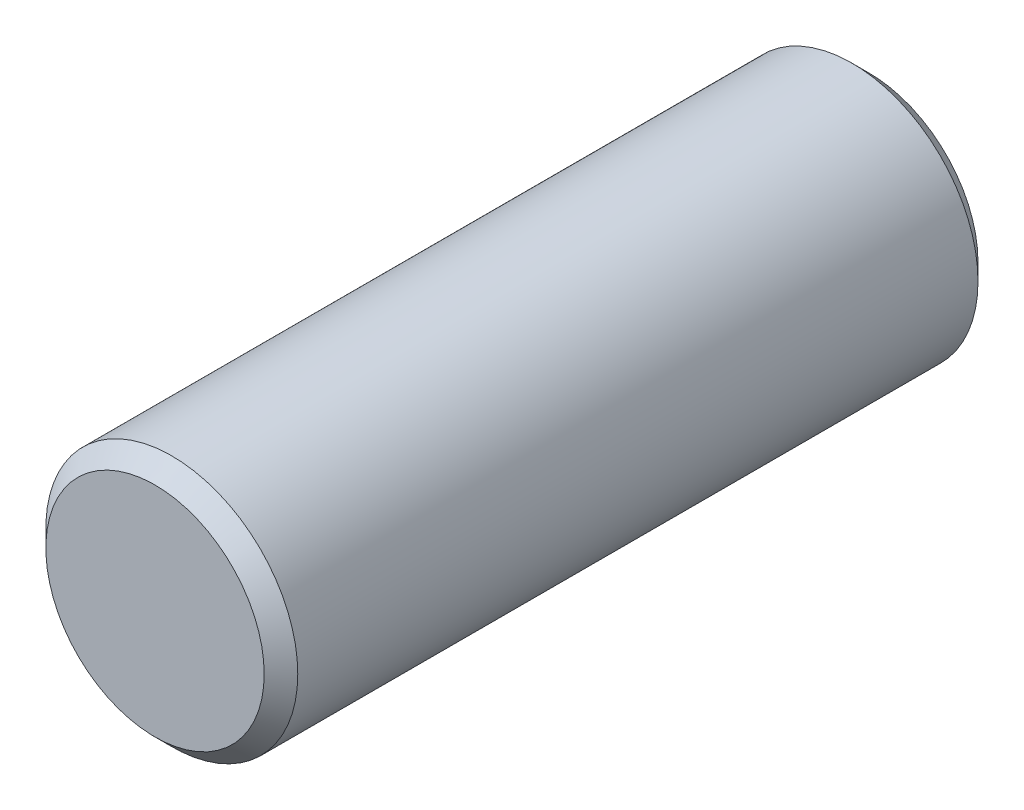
from build123d import *

# Parameters (mm, degrees)
IZIM1_R                     = 15
Y_KSEKLIK_EKSTR_ZYON1_DEPTH = 85
PAH1_SIZE                   = 2


with BuildPart() as part:
    # izim1 → Y_kseklik-Ekstr_zyon1 (new body)
    with BuildSketch(Plane.XY):
        Circle(IZIM1_R)
    extrude(amount=Y_KSEKLIK_EKSTR_ZYON1_DEPTH)

    # Pah1
    pah1_edges = [part.edges().sort_by_distance(p)[0] for p in [
        (-15, 0, 0),
        (-15, 0, 85),
    ]]
    chamfer(pah1_edges, length=PAH1_SIZE)


solid = part.part
